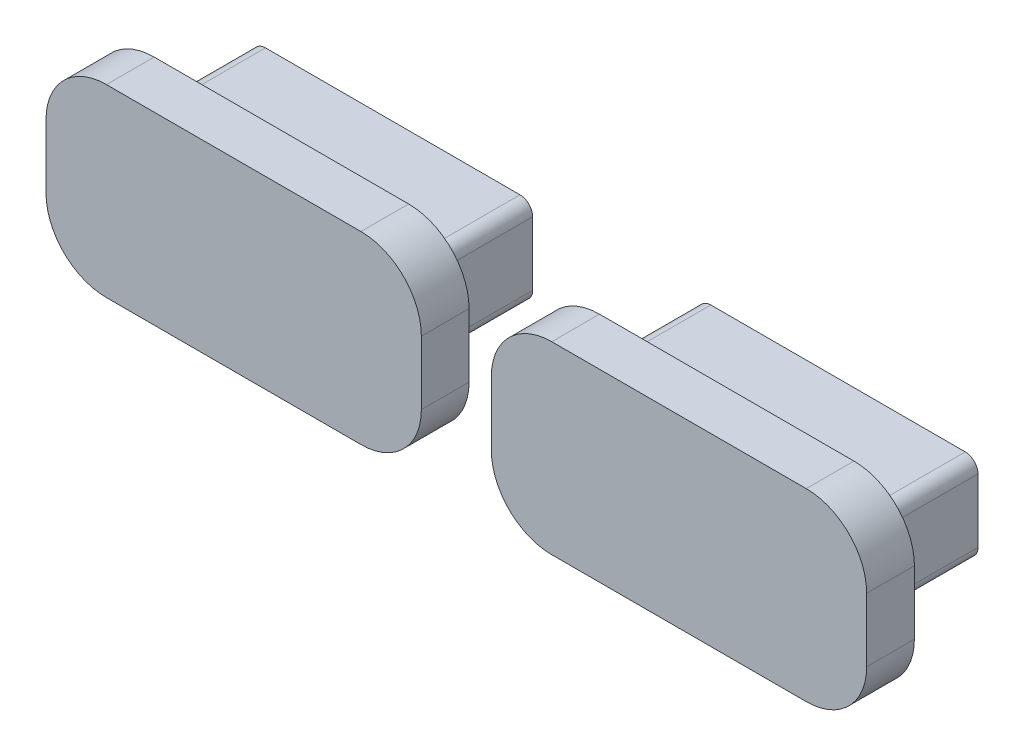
from build123d import *

# Parameters (mm, degrees)
BOSS_EXTRUDE1_DEPTH   = 1.905
BOSS_EXTRUDE1_2_DEPTH = 1.905
BOSS_EXTRUDE2_DEPTH   = 4.445
BOSS_EXTRUDE2_2_DEPTH = 4.445


with BuildPart() as part:
    # Sketch1 → Boss-Extrude1 (new body)
    with BuildSketch(Plane.XY):
        with BuildLine():
            Line((18.908, -55.245), (18.908, -52.705))
            ThreePointArc((18.908, -52.705), (18.201248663, -50.998751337), (16.495, -50.292))
            Line((16.495, -50.292), (6.335, -50.292))
            ThreePointArc((6.335, -50.292), (4.628751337, -50.998751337), (3.922, -52.705))
            Line((3.922, -52.705), (3.922, -55.245))
            ThreePointArc((3.922, -55.245), (4.628751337, -56.951248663), (6.335, -57.658))
            Line((6.335, -57.658), (16.495, -57.658))
            ThreePointArc((16.495, -57.658), (18.201248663, -56.951248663), (18.908, -55.245))
        make_face()
    extrude(amount=-BOSS_EXTRUDE1_DEPTH)


with BuildPart() as body_2:
    # Sketch1 → Boss-Extrude1 2 (new body)
    with BuildSketch(Plane.XY):
        with BuildLine():
            Line((21.702, -52.705), (21.702, -55.245))
            ThreePointArc((21.702, -55.245), (22.408751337, -56.951248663), (24.115, -57.658))
            Line((24.115, -57.658), (34.275, -57.658))
            ThreePointArc((34.275, -57.658), (35.981248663, -56.951248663), (36.688, -55.245))
            Line((36.688, -55.245), (36.688, -52.705))
            ThreePointArc((36.688, -52.705), (35.981248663, -50.998751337), (34.275, -50.292))
            Line((34.275, -50.292), (24.115, -50.292))
            ThreePointArc((24.115, -50.292), (22.408751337, -50.998751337), (21.702, -52.705))
        make_face()
    extrude(amount=-BOSS_EXTRUDE1_2_DEPTH)


with BuildPart() as body_3:
    # Sketch2 → Boss-Extrude2 (new body)
    with BuildSketch(Plane(origin=(0, 0, -1.905), x_dir=(-1, 0, 0), z_dir=(0, 0, -1))):
        with BuildLine():
            Line((-5.827, -55.245), (-5.827, -52.705))
            ThreePointArc((-5.827, -52.705), (-5.975789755, -52.345789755), (-6.335, -52.197))
            Line((-6.335, -52.197), (-16.495, -52.197))
            ThreePointArc((-16.495, -52.197), (-16.854210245, -52.345789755), (-17.003, -52.705))
            Line((-17.003, -52.705), (-17.003, -55.245))
            ThreePointArc((-17.003, -55.245), (-16.854210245, -55.604210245), (-16.495, -55.753))
            Line((-16.495, -55.753), (-6.335, -55.753))
            ThreePointArc((-6.335, -55.753), (-5.975789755, -55.604210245), (-5.827, -55.245))
        make_face()
    extrude(amount=BOSS_EXTRUDE2_DEPTH)


with BuildPart() as body_4:
    # Sketch2 → Boss-Extrude2 2 (new body)
    with BuildSketch(Plane(origin=(0, 0, -1.905), x_dir=(-1, 0, 0), z_dir=(0, 0, -1))):
        with BuildLine():
            Line((-34.783, -52.705), (-34.783, -55.245))
            ThreePointArc((-34.783, -55.245), (-34.634210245, -55.604210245), (-34.275, -55.753))
            Line((-34.275, -55.753), (-24.115, -55.753))
            ThreePointArc((-24.115, -55.753), (-23.755789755, -55.604210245), (-23.607, -55.245))
            Line((-23.607, -55.245), (-23.607, -52.705))
            ThreePointArc((-23.607, -52.705), (-23.755789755, -52.345789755), (-24.115, -52.197))
            Line((-24.115, -52.197), (-34.275, -52.197))
            ThreePointArc((-34.275, -52.197), (-34.634210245, -52.345789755), (-34.783, -52.705))
        make_face()
    extrude(amount=BOSS_EXTRUDE2_2_DEPTH)


solid = Compound([part.part, body_2.part, body_3.part, body_4.part])
